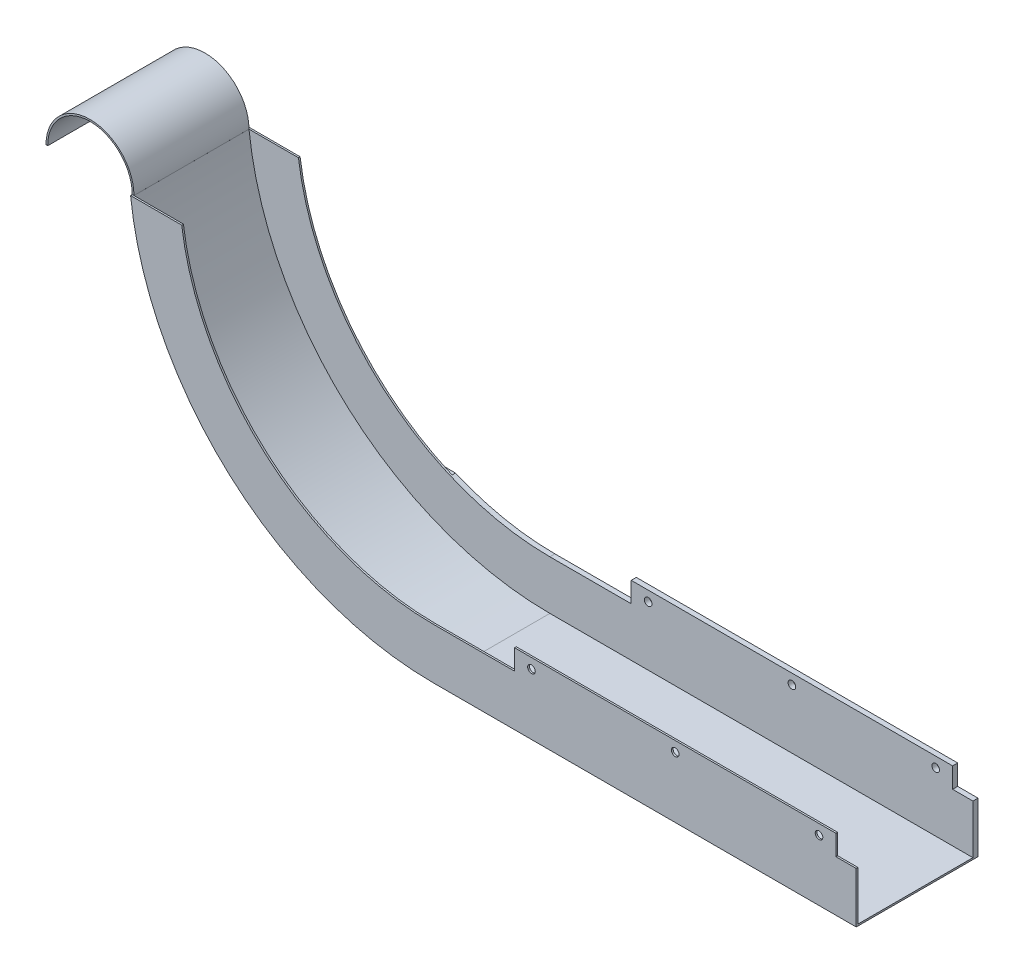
ISO-10303-21;
HEADER;
FILE_DESCRIPTION(('STEP AP214'),'2;1');
FILE_NAME('part.step','',(''),(''),'','','');
FILE_SCHEMA(('AUTOMOTIVE_DESIGN { 1 0 10303 214 1 1 1 1 }'));
ENDSEC;
DATA;
#1=APPLICATION_CONTEXT('core data for automotive mechanical design processes');
#2=APPLICATION_PROTOCOL_DEFINITION('international standard','automotive_design',2000,#1);
#3=PRODUCT_CONTEXT('',#1,'mechanical');
#4=PRODUCT('Part','Part','',(#3));
#5=PRODUCT_RELATED_PRODUCT_CATEGORY('part','',(#4));
#6=PRODUCT_DEFINITION_FORMATION('','',#4);
#7=PRODUCT_DEFINITION_CONTEXT('part definition',#1,'design');
#8=PRODUCT_DEFINITION('design','',#6,#7);
#9=PRODUCT_DEFINITION_SHAPE('','',#8);
#10=(LENGTH_UNIT() NAMED_UNIT(*) SI_UNIT(.MILLI.,.METRE.));
#11=(NAMED_UNIT(*) PLANE_ANGLE_UNIT() SI_UNIT($,.RADIAN.));
#12=(NAMED_UNIT(*) SI_UNIT($,.STERADIAN.) SOLID_ANGLE_UNIT());
#13=UNCERTAINTY_MEASURE_WITH_UNIT(LENGTH_MEASURE(1.E-05),#10,'distance_accuracy_value','');
#14=(GEOMETRIC_REPRESENTATION_CONTEXT(3) GLOBAL_UNCERTAINTY_ASSIGNED_CONTEXT((#13)) GLOBAL_UNIT_ASSIGNED_CONTEXT((#10,
#11,#12)) REPRESENTATION_CONTEXT('',''));
#15=CARTESIAN_POINT('',(0.,0.,0.));
#16=DIRECTION('',(0.,0.,1.));
#17=DIRECTION('',(1.,0.,0.));
#18=AXIS2_PLACEMENT_3D('',#15,#16,#17);
#19=CARTESIAN_POINT('',(468.,41.9999999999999,72.));
#20=DIRECTION('',(0.,-1.,0.));
#21=DIRECTION('',(1.,0.,0.));
#22=AXIS2_PLACEMENT_3D('',#19,#20,#21);
#23=PLANE('',#22);
#24=DIRECTION('',(0.,0.,-1.));
#25=VECTOR('',#24,1.);
#26=CARTESIAN_POINT('',(480.,42.0000000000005,72.));
#27=LINE('',#26,#25);
#28=CARTESIAN_POINT('',(480.,42.0000000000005,72.));
#29=VERTEX_POINT('',#28);
#30=CARTESIAN_POINT('',(480.,42.0000000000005,71.));
#31=VERTEX_POINT('',#30);
#32=EDGE_CURVE('E446',#29,#31,#27,.T.);
#33=ORIENTED_EDGE('',*,*,#32,.T.);
#34=DIRECTION('',(-1.,0.,0.));
#35=VECTOR('',#34,1.);
#36=CARTESIAN_POINT('',(468.,41.9999999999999,71.));
#37=LINE('',#36,#35);
#38=CARTESIAN_POINT('',(468.,41.9999999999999,71.));
#39=VERTEX_POINT('',#38);
#40=EDGE_CURVE('E306',#31,#39,#37,.T.);
#41=ORIENTED_EDGE('',*,*,#40,.T.);
#42=DIRECTION('',(0.,0.,-1.));
#43=VECTOR('',#42,1.);
#44=CARTESIAN_POINT('',(468.,41.9999999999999,72.));
#45=LINE('',#44,#43);
#46=CARTESIAN_POINT('',(468.,41.9999999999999,72.));
#47=VERTEX_POINT('',#46);
#48=EDGE_CURVE('E496',#47,#39,#45,.T.);
#49=ORIENTED_EDGE('',*,*,#48,.F.);
#50=DIRECTION('',(-1.,0.,0.));
#51=VECTOR('',#50,1.);
#52=CARTESIAN_POINT('',(468.,41.9999999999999,72.));
#53=LINE('',#52,#51);
#54=EDGE_CURVE('E386',#29,#47,#53,.T.);
#55=ORIENTED_EDGE('',*,*,#54,.F.);
#56=EDGE_LOOP('',(#33,#41,#49,#55));
#57=FACE_BOUND('',#56,.T.);
#58=ADVANCED_FACE('F32',(#57),#23,.F.);
#59=CARTESIAN_POINT('',(468.,41.9999999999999,72.));
#60=DIRECTION('',(-1.,0.,0.));
#61=DIRECTION('',(0.,0.,1.));
#62=AXIS2_PLACEMENT_3D('',#59,#60,#61);
#63=PLANE('',#62);
#64=ORIENTED_EDGE('',*,*,#48,.T.);
#65=DIRECTION('',(0.,1.,0.));
#66=VECTOR('',#65,1.);
#67=CARTESIAN_POINT('',(468.,41.9999999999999,71.));
#68=LINE('',#67,#66);
#69=CARTESIAN_POINT('',(468.,54.,71.));
#70=VERTEX_POINT('',#69);
#71=EDGE_CURVE('E303',#39,#70,#68,.T.);
#72=ORIENTED_EDGE('',*,*,#71,.T.);
#73=DIRECTION('',(0.,0.,-1.));
#74=VECTOR('',#73,1.);
#75=CARTESIAN_POINT('',(468.,54.,72.));
#76=LINE('',#75,#74);
#77=CARTESIAN_POINT('',(468.,54.,72.));
#78=VERTEX_POINT('',#77);
#79=EDGE_CURVE('E492',#78,#70,#76,.T.);
#80=ORIENTED_EDGE('',*,*,#79,.F.);
#81=DIRECTION('',(0.,1.,0.));
#82=VECTOR('',#81,1.);
#83=CARTESIAN_POINT('',(468.,41.9999999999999,72.));
#84=LINE('',#83,#82);
#85=EDGE_CURVE('E389',#47,#78,#84,.T.);
#86=ORIENTED_EDGE('',*,*,#85,.F.);
#87=EDGE_LOOP('',(#64,#72,#80,#86));
#88=FACE_BOUND('',#87,.T.);
#89=ADVANCED_FACE('F570',(#88),#63,.F.);
#90=CARTESIAN_POINT('',(278.,54.,72.));
#91=DIRECTION('',(0.,-1.,0.));
#92=DIRECTION('',(0.,0.,-1.));
#93=AXIS2_PLACEMENT_3D('',#90,#91,#92);
#94=PLANE('',#93);
#95=ORIENTED_EDGE('',*,*,#79,.T.);
#96=DIRECTION('',(-1.,0.,0.));
#97=VECTOR('',#96,1.);
#98=CARTESIAN_POINT('',(278.,54.,71.));
#99=LINE('',#98,#97);
#100=CARTESIAN_POINT('',(278.,54.,71.));
#101=VERTEX_POINT('',#100);
#102=EDGE_CURVE('E300',#70,#101,#99,.T.);
#103=ORIENTED_EDGE('',*,*,#102,.T.);
#104=DIRECTION('',(0.,0.,-1.));
#105=VECTOR('',#104,1.);
#106=CARTESIAN_POINT('',(278.,54.,72.));
#107=LINE('',#106,#105);
#108=CARTESIAN_POINT('',(278.,54.,72.));
#109=VERTEX_POINT('',#108);
#110=EDGE_CURVE('E488',#109,#101,#107,.T.);
#111=ORIENTED_EDGE('',*,*,#110,.F.);
#112=DIRECTION('',(-1.,0.,0.));
#113=VECTOR('',#112,1.);
#114=CARTESIAN_POINT('',(278.,54.,72.));
#115=LINE('',#114,#113);
#116=EDGE_CURVE('E392',#78,#109,#115,.T.);
#117=ORIENTED_EDGE('',*,*,#116,.F.);
#118=EDGE_LOOP('',(#95,#103,#111,#117));
#119=FACE_BOUND('',#118,.T.);
#120=ADVANCED_FACE('F566',(#119),#94,.F.);
#121=CARTESIAN_POINT('',(278.,41.9999999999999,72.));
#122=DIRECTION('',(1.,0.,0.));
#123=DIRECTION('',(0.,0.,-1.));
#124=AXIS2_PLACEMENT_3D('',#121,#122,#123);
#125=PLANE('',#124);
#126=ORIENTED_EDGE('',*,*,#110,.T.);
#127=DIRECTION('',(0.,-1.,0.));
#128=VECTOR('',#127,1.);
#129=CARTESIAN_POINT('',(278.,41.9999999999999,71.));
#130=LINE('',#129,#128);
#131=CARTESIAN_POINT('',(278.,41.9999999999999,71.));
#132=VERTEX_POINT('',#131);
#133=EDGE_CURVE('E297',#101,#132,#130,.T.);
#134=ORIENTED_EDGE('',*,*,#133,.T.);
#135=DIRECTION('',(0.,0.,-1.));
#136=VECTOR('',#135,1.);
#137=CARTESIAN_POINT('',(278.,41.9999999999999,72.));
#138=LINE('',#137,#136);
#139=CARTESIAN_POINT('',(278.,41.9999999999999,72.));
#140=VERTEX_POINT('',#139);
#141=EDGE_CURVE('E484',#140,#132,#138,.T.);
#142=ORIENTED_EDGE('',*,*,#141,.F.);
#143=DIRECTION('',(0.,-1.,0.));
#144=VECTOR('',#143,1.);
#145=CARTESIAN_POINT('',(278.,41.9999999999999,72.));
#146=LINE('',#145,#144);
#147=EDGE_CURVE('E394',#109,#140,#146,.T.);
#148=ORIENTED_EDGE('',*,*,#147,.F.);
#149=EDGE_LOOP('',(#126,#134,#142,#148));
#150=FACE_BOUND('',#149,.T.);
#151=ADVANCED_FACE('F563',(#150),#125,.F.);
#152=CARTESIAN_POINT('',(229.885438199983,41.9999999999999,72.));
#153=DIRECTION('',(0.,-1.,0.));
#154=DIRECTION('',(0.,0.,-1.));
#155=AXIS2_PLACEMENT_3D('',#152,#153,#154);
#156=PLANE('',#155);
#157=ORIENTED_EDGE('',*,*,#141,.T.);
#158=DIRECTION('',(-1.,0.,0.));
#159=VECTOR('',#158,1.);
#160=CARTESIAN_POINT('',(229.885438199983,41.9999999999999,71.));
#161=LINE('',#160,#159);
#162=CARTESIAN_POINT('',(229.885438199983,42.0000000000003,71.));
#163=VERTEX_POINT('',#162);
#164=EDGE_CURVE('E294',#132,#163,#161,.T.);
#165=ORIENTED_EDGE('',*,*,#164,.T.);
#166=DIRECTION('',(0.,0.,-1.));
#167=VECTOR('',#166,1.);
#168=CARTESIAN_POINT('',(229.885438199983,41.9999999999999,72.));
#169=LINE('',#168,#167);
#170=CARTESIAN_POINT('',(229.885438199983,41.9999999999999,72.));
#171=VERTEX_POINT('',#170);
#172=EDGE_CURVE('E480',#171,#163,#169,.T.);
#173=ORIENTED_EDGE('',*,*,#172,.F.);
#174=DIRECTION('',(-1.,0.,0.));
#175=VECTOR('',#174,1.);
#176=CARTESIAN_POINT('',(229.885438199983,41.9999999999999,72.));
#177=LINE('',#176,#175);
#178=EDGE_CURVE('E396',#140,#171,#177,.T.);
#179=ORIENTED_EDGE('',*,*,#178,.F.);
#180=EDGE_LOOP('',(#157,#165,#173,#179));
#181=FACE_BOUND('',#180,.T.);
#182=ADVANCED_FACE('F558',(#181),#156,.F.);
#183=CARTESIAN_POINT('',(229.885438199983,192.,72.));
#184=DIRECTION('',(0.,0.,-1.));
#185=DIRECTION('',(-1.,0.,0.));
#186=AXIS2_PLACEMENT_3D('',#183,#184,#185);
#187=CYLINDRICAL_SURFACE('',#186,150.);
#188=ORIENTED_EDGE('',*,*,#172,.T.);
#189=CARTESIAN_POINT('',(229.885438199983,192.,71.));
#190=DIRECTION('',(0.,0.,1.));
#191=DIRECTION('',(1.,0.,0.));
#192=AXIS2_PLACEMENT_3D('',#189,#190,#191);
#193=CIRCLE('',#192,150.);
#194=CARTESIAN_POINT('',(81.224750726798,171.999999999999,71.));
#195=VERTEX_POINT('',#194);
#196=EDGE_CURVE('E291',#163,#195,#193,.F.);
#197=ORIENTED_EDGE('',*,*,#196,.T.);
#198=DIRECTION('',(0.,0.,-1.));
#199=VECTOR('',#198,1.);
#200=CARTESIAN_POINT('',(81.224750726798,172.,72.));
#201=LINE('',#200,#199);
#202=CARTESIAN_POINT('',(81.224750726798,172.,72.));
#203=VERTEX_POINT('',#202);
#204=EDGE_CURVE('E476',#203,#195,#201,.T.);
#205=ORIENTED_EDGE('',*,*,#204,.F.);
#206=CARTESIAN_POINT('',(229.885438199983,192.,72.));
#207=DIRECTION('',(0.,0.,-1.));
#208=DIRECTION('',(1.,0.,0.));
#209=AXIS2_PLACEMENT_3D('',#206,#207,#208);
#210=CIRCLE('',#209,150.);
#211=EDGE_CURVE('E398',#171,#203,#210,.T.);
#212=ORIENTED_EDGE('',*,*,#211,.F.);
#213=EDGE_LOOP('',(#188,#197,#205,#212));
#214=FACE_BOUND('',#213,.T.);
#215=ADVANCED_FACE('F555',(#214),#187,.F.);
#216=CARTESIAN_POINT('',(458.,47.9999999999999,72.));
#217=DIRECTION('',(0.,0.,-1.));
#218=DIRECTION('',(-1.,0.,0.));
#219=AXIS2_PLACEMENT_3D('',#216,#217,#218);
#220=CYLINDRICAL_SURFACE('',#219,2.24999999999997);
#221=CARTESIAN_POINT('',(458.,47.9999999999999,71.));
#222=DIRECTION('',(0.,0.,1.));
#223=DIRECTION('',(1.,0.,0.));
#224=AXIS2_PLACEMENT_3D('',#221,#222,#223);
#225=CIRCLE('',#224,2.24999999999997);
#226=CARTESIAN_POINT('',(460.25,47.9999999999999,71.));
#227=VERTEX_POINT('',#226);
#228=EDGE_CURVE('E288',#227,#227,#225,.T.);
#229=ORIENTED_EDGE('',*,*,#228,.F.);
#230=EDGE_LOOP('',(#229));
#231=FACE_BOUND('',#230,.T.);
#232=CARTESIAN_POINT('',(458.,47.9999999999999,72.));
#233=DIRECTION('',(0.,0.,1.));
#234=DIRECTION('',(1.,0.,0.));
#235=AXIS2_PLACEMENT_3D('',#232,#233,#234);
#236=CIRCLE('',#235,2.24999999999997);
#237=CARTESIAN_POINT('',(460.25,47.9999999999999,72.));
#238=VERTEX_POINT('',#237);
#239=EDGE_CURVE('E371',#238,#238,#236,.T.);
#240=ORIENTED_EDGE('',*,*,#239,.T.);
#241=EDGE_LOOP('',(#240));
#242=FACE_BOUND('',#241,.T.);
#243=ADVANCED_FACE('F693',(#231,#242),#220,.F.);
#244=CARTESIAN_POINT('',(373.,47.9999999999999,72.));
#245=DIRECTION('',(0.,0.,-1.));
#246=DIRECTION('',(-1.,0.,0.));
#247=AXIS2_PLACEMENT_3D('',#244,#245,#246);
#248=CYLINDRICAL_SURFACE('',#247,2.24999999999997);
#249=CARTESIAN_POINT('',(373.,47.9999999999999,71.));
#250=DIRECTION('',(0.,0.,1.));
#251=DIRECTION('',(1.,0.,0.));
#252=AXIS2_PLACEMENT_3D('',#249,#250,#251);
#253=CIRCLE('',#252,2.24999999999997);
#254=CARTESIAN_POINT('',(375.25,47.9999999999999,71.));
#255=VERTEX_POINT('',#254);
#256=EDGE_CURVE('E285',#255,#255,#253,.T.);
#257=ORIENTED_EDGE('',*,*,#256,.F.);
#258=EDGE_LOOP('',(#257));
#259=FACE_BOUND('',#258,.T.);
#260=CARTESIAN_POINT('',(373.,47.9999999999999,72.));
#261=DIRECTION('',(0.,0.,1.));
#262=DIRECTION('',(1.,0.,0.));
#263=AXIS2_PLACEMENT_3D('',#260,#261,#262);
#264=CIRCLE('',#263,2.24999999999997);
#265=CARTESIAN_POINT('',(375.25,47.9999999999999,72.));
#266=VERTEX_POINT('',#265);
#267=EDGE_CURVE('E365',#266,#266,#264,.T.);
#268=ORIENTED_EDGE('',*,*,#267,.T.);
#269=EDGE_LOOP('',(#268));
#270=FACE_BOUND('',#269,.T.);
#271=ADVANCED_FACE('F697',(#259,#270),#248,.F.);
#272=CARTESIAN_POINT('',(288.,48.,72.));
#273=DIRECTION('',(0.,0.,-1.));
#274=DIRECTION('',(-1.,0.,0.));
#275=AXIS2_PLACEMENT_3D('',#272,#273,#274);
#276=CYLINDRICAL_SURFACE('',#275,2.24999999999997);
#277=CARTESIAN_POINT('',(288.,48.,71.));
#278=DIRECTION('',(0.,0.,1.));
#279=DIRECTION('',(1.,0.,0.));
#280=AXIS2_PLACEMENT_3D('',#277,#278,#279);
#281=CIRCLE('',#280,2.24999999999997);
#282=CARTESIAN_POINT('',(290.25,48.,71.));
#283=VERTEX_POINT('',#282);
#284=EDGE_CURVE('E36',#283,#283,#281,.T.);
#285=ORIENTED_EDGE('',*,*,#284,.F.);
#286=EDGE_LOOP('',(#285));
#287=FACE_BOUND('',#286,.T.);
#288=CARTESIAN_POINT('',(288.,48.,72.));
#289=DIRECTION('',(0.,0.,1.));
#290=DIRECTION('',(1.,0.,0.));
#291=AXIS2_PLACEMENT_3D('',#288,#289,#290);
#292=CIRCLE('',#291,2.24999999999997);
#293=CARTESIAN_POINT('',(290.25,48.,72.));
#294=VERTEX_POINT('',#293);
#295=EDGE_CURVE('E359',#294,#294,#292,.T.);
#296=ORIENTED_EDGE('',*,*,#295,.T.);
#297=EDGE_LOOP('',(#296));
#298=FACE_BOUND('',#297,.T.);
#299=ADVANCED_FACE('F654',(#287,#298),#276,.F.);
#300=CARTESIAN_POINT('',(229.885438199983,192.,0.));
#301=DIRECTION('',(0.,0.,1.));
#302=DIRECTION('',(1.,0.,0.));
#303=AXIS2_PLACEMENT_3D('',#300,#301,#302);
#304=PLANE('',#303);
#305=CARTESIAN_POINT('',(288.,48.,0.));
#306=DIRECTION('',(0.,0.,1.));
#307=DIRECTION('',(1.,0.,0.));
#308=AXIS2_PLACEMENT_3D('',#305,#306,#307);
#309=CIRCLE('',#308,2.24999999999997);
#310=CARTESIAN_POINT('',(290.25,48.,0.));
#311=VERTEX_POINT('',#310);
#312=EDGE_CURVE('E358',#311,#311,#309,.T.);
#313=ORIENTED_EDGE('',*,*,#312,.T.);
#314=EDGE_LOOP('',(#313));
#315=FACE_BOUND('',#314,.T.);
#316=CARTESIAN_POINT('',(458.,47.9999999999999,0.));
#317=DIRECTION('',(0.,0.,1.));
#318=DIRECTION('',(1.,0.,0.));
#319=AXIS2_PLACEMENT_3D('',#316,#317,#318);
#320=CIRCLE('',#319,2.24999999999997);
#321=CARTESIAN_POINT('',(460.25,47.9999999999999,0.));
#322=VERTEX_POINT('',#321);
#323=EDGE_CURVE('E368',#322,#322,#320,.T.);
#324=ORIENTED_EDGE('',*,*,#323,.T.);
#325=EDGE_LOOP('',(#324));
#326=FACE_BOUND('',#325,.T.);
#327=CARTESIAN_POINT('',(373.,6.,0.));
#328=DIRECTION('',(0.,0.,1.));
#329=DIRECTION('',(1.,0.,0.));
#330=AXIS2_PLACEMENT_3D('',#327,#328,#329);
#331=CIRCLE('',#330,2.24999999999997);
#332=CARTESIAN_POINT('',(375.25,6.,0.));
#333=VERTEX_POINT('',#332);
#334=EDGE_CURVE('E379',#333,#333,#331,.T.);
#335=ORIENTED_EDGE('',*,*,#334,.T.);
#336=EDGE_LOOP('',(#335));
#337=FACE_BOUND('',#336,.T.);
#338=CARTESIAN_POINT('',(288.,6.,0.));
#339=DIRECTION('',(0.,0.,1.));
#340=DIRECTION('',(1.,0.,0.));
#341=AXIS2_PLACEMENT_3D('',#338,#339,#340);
#342=CIRCLE('',#341,2.24999999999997);
#343=CARTESIAN_POINT('',(290.25,6.,0.));
#344=VERTEX_POINT('',#343);
#345=EDGE_CURVE('E382',#344,#344,#342,.T.);
#346=ORIENTED_EDGE('',*,*,#345,.T.);
#347=EDGE_LOOP('',(#346));
#348=FACE_BOUND('',#347,.T.);
#349=CARTESIAN_POINT('',(458.,6.,0.));
#350=DIRECTION('',(0.,0.,1.));
#351=DIRECTION('',(1.,0.,0.));
#352=AXIS2_PLACEMENT_3D('',#349,#350,#351);
#353=CIRCLE('',#352,2.24999999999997);
#354=CARTESIAN_POINT('',(460.25,6.,0.));
#355=VERTEX_POINT('',#354);
#356=EDGE_CURVE('E374',#355,#355,#353,.T.);
#357=ORIENTED_EDGE('',*,*,#356,.T.);
#358=EDGE_LOOP('',(#357));
#359=FACE_BOUND('',#358,.T.);
#360=CARTESIAN_POINT('',(373.,47.9999999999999,0.));
#361=DIRECTION('',(0.,0.,1.));
#362=DIRECTION('',(1.,0.,0.));
#363=AXIS2_PLACEMENT_3D('',#360,#361,#362);
#364=CIRCLE('',#363,2.24999999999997);
#365=CARTESIAN_POINT('',(375.25,47.9999999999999,0.));
#366=VERTEX_POINT('',#365);
#367=EDGE_CURVE('E362',#366,#366,#364,.T.);
#368=ORIENTED_EDGE('',*,*,#367,.T.);
#369=EDGE_LOOP('',(#368));
#370=FACE_BOUND('',#369,.T.);
#371=DIRECTION('',(-1.,0.,0.));
#372=VECTOR('',#371,1.);
#373=CARTESIAN_POINT('',(1150.25281380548,54.,0.));
#374=LINE('',#373,#372);
#375=CARTESIAN_POINT('',(171.097684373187,54.,0.));
#376=VERTEX_POINT('',#375);
#377=CARTESIAN_POINT('',(114.317276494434,54.,0.));
#378=VERTEX_POINT('',#377);
#379=EDGE_CURVE('E309',#376,#378,#374,.T.);
#380=ORIENTED_EDGE('',*,*,#379,.F.);
#381=CARTESIAN_POINT('',(229.885438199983,192.,0.));
#382=DIRECTION('',(0.,0.,-1.));
#383=DIRECTION('',(1.,0.,0.));
#384=AXIS2_PLACEMENT_3D('',#381,#382,#383);
#385=CIRCLE('',#384,150.);
#386=CARTESIAN_POINT('',(229.885438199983,41.9999999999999,0.));
#387=VERTEX_POINT('',#386);
#388=EDGE_CURVE('E423',#387,#376,#385,.T.);
#389=ORIENTED_EDGE('',*,*,#388,.F.);
#390=DIRECTION('',(-1.,0.,0.));
#391=VECTOR('',#390,1.);
#392=CARTESIAN_POINT('',(229.885438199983,41.9999999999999,0.));
#393=LINE('',#392,#391);
#394=CARTESIAN_POINT('',(278.,41.9999999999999,0.));
#395=VERTEX_POINT('',#394);
#396=EDGE_CURVE('E420',#395,#387,#393,.T.);
#397=ORIENTED_EDGE('',*,*,#396,.F.);
#398=DIRECTION('',(0.,-1.,0.));
#399=VECTOR('',#398,1.);
#400=CARTESIAN_POINT('',(278.,41.9999999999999,0.));
#401=LINE('',#400,#399);
#402=CARTESIAN_POINT('',(278.,54.,0.));
#403=VERTEX_POINT('',#402);
#404=EDGE_CURVE('E417',#403,#395,#401,.T.);
#405=ORIENTED_EDGE('',*,*,#404,.F.);
#406=DIRECTION('',(-1.,0.,0.));
#407=VECTOR('',#406,1.);
#408=CARTESIAN_POINT('',(278.,54.,0.));
#409=LINE('',#408,#407);
#410=CARTESIAN_POINT('',(468.,54.,0.));
#411=VERTEX_POINT('',#410);
#412=EDGE_CURVE('E414',#411,#403,#409,.T.);
#413=ORIENTED_EDGE('',*,*,#412,.F.);
#414=DIRECTION('',(0.,1.,0.));
#415=VECTOR('',#414,1.);
#416=CARTESIAN_POINT('',(468.,41.9999999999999,0.));
#417=LINE('',#416,#415);
#418=CARTESIAN_POINT('',(468.,41.9999999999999,0.));
#419=VERTEX_POINT('',#418);
#420=EDGE_CURVE('E411',#419,#411,#417,.T.);
#421=ORIENTED_EDGE('',*,*,#420,.F.);
#422=DIRECTION('',(-1.,0.,0.));
#423=VECTOR('',#422,1.);
#424=CARTESIAN_POINT('',(468.,41.9999999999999,0.));
#425=LINE('',#424,#423);
#426=CARTESIAN_POINT('',(480.,42.0000000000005,0.));
#427=VERTEX_POINT('',#426);
#428=EDGE_CURVE('E385',#427,#419,#425,.T.);
#429=ORIENTED_EDGE('',*,*,#428,.F.);
#430=DIRECTION('',(0.,1.,0.));
#431=VECTOR('',#430,1.);
#432=CARTESIAN_POINT('',(480.,12.0000000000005,0.));
#433=LINE('',#432,#431);
#434=CARTESIAN_POINT('',(480.,12.0000000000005,0.));
#435=VERTEX_POINT('',#434);
#436=EDGE_CURVE('E390',#435,#427,#433,.T.);
#437=ORIENTED_EDGE('',*,*,#436,.F.);
#438=DIRECTION('',(1.,0.,0.));
#439=VECTOR('',#438,1.);
#440=CARTESIAN_POINT('',(468.,11.9999999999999,0.));
#441=LINE('',#440,#439);
#442=CARTESIAN_POINT('',(468.,11.9999999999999,0.));
#443=VERTEX_POINT('',#442);
#444=EDGE_CURVE('E441',#443,#435,#441,.T.);
#445=ORIENTED_EDGE('',*,*,#444,.F.);
#446=DIRECTION('',(0.,1.,0.));
#447=VECTOR('',#446,1.);
#448=CARTESIAN_POINT('',(468.,-1.13686837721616E-13,0.));
#449=LINE('',#448,#447);
#450=CARTESIAN_POINT('',(468.,-1.13686837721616E-13,0.));
#451=VERTEX_POINT('',#450);
#452=EDGE_CURVE('E438',#451,#443,#449,.T.);
#453=ORIENTED_EDGE('',*,*,#452,.F.);
#454=DIRECTION('',(1.,0.,0.));
#455=VECTOR('',#454,1.);
#456=CARTESIAN_POINT('',(278.,-1.13686837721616E-13,0.));
#457=LINE('',#456,#455);
#458=CARTESIAN_POINT('',(278.,-1.13686837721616E-13,0.));
#459=VERTEX_POINT('',#458);
#460=EDGE_CURVE('E435',#459,#451,#457,.T.);
#461=ORIENTED_EDGE('',*,*,#460,.F.);
#462=DIRECTION('',(0.,-1.,0.));
#463=VECTOR('',#462,1.);
#464=CARTESIAN_POINT('',(278.,-1.13686837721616E-13,0.));
#465=LINE('',#464,#463);
#466=CARTESIAN_POINT('',(278.,11.9999999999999,0.));
#467=VERTEX_POINT('',#466);
#468=EDGE_CURVE('E432',#467,#459,#465,.T.);
#469=ORIENTED_EDGE('',*,*,#468,.F.);
#470=DIRECTION('',(1.,0.,0.));
#471=VECTOR('',#470,1.);
#472=CARTESIAN_POINT('',(229.885438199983,11.9999999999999,0.));
#473=LINE('',#472,#471);
#474=CARTESIAN_POINT('',(229.885438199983,12.0000000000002,0.));
#475=VERTEX_POINT('',#474);
#476=EDGE_CURVE('E429',#475,#467,#473,.T.);
#477=ORIENTED_EDGE('',*,*,#476,.F.);
#478=CARTESIAN_POINT('',(229.885438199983,192.,0.));
#479=DIRECTION('',(0.,0.,1.));
#480=DIRECTION('',(1.,0.,0.));
#481=AXIS2_PLACEMENT_3D('',#478,#479,#480);
#482=CIRCLE('',#481,180.);
#483=EDGE_CURVE('E426',#378,#475,#482,.T.);
#484=ORIENTED_EDGE('',*,*,#483,.F.);
#485=EDGE_LOOP('',(#380,#389,#397,#405,#413,#421,#429,#437,#445,#453,#461,#469,#477,#484));
#486=FACE_BOUND('',#485,.T.);
#487=ADVANCED_FACE('F528',(#315,#326,#337,#348,#359,#370,#486),#304,.F.);
#488=CARTESIAN_POINT('',(0.,172.,72.));
#489=DIRECTION('',(0.,1.,0.));
#490=DIRECTION('',(0.,0.,1.));
#491=AXIS2_PLACEMENT_3D('',#488,#489,#490);
#492=PLANE('',#491);
#493=DIRECTION('',(0.,0.,-1.));
#494=VECTOR('',#493,1.);
#495=CARTESIAN_POINT('',(1.,172.,72.));
#496=LINE('',#495,#494);
#497=CARTESIAN_POINT('',(1.,172.,71.));
#498=VERTEX_POINT('',#497);
#499=CARTESIAN_POINT('',(0.99999999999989,172.,3.));
#500=VERTEX_POINT('',#499);
#501=EDGE_CURVE('E465',#498,#500,#496,.T.);
#502=ORIENTED_EDGE('',*,*,#501,.F.);
#503=DIRECTION('',(-1.,0.,0.));
#504=VECTOR('',#503,1.);
#505=CARTESIAN_POINT('',(1150.25281380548,172.,71.));
#506=LINE('',#505,#504);
#507=CARTESIAN_POINT('',(0.,172.,71.));
#508=VERTEX_POINT('',#507);
#509=EDGE_CURVE('E321',#498,#508,#506,.T.);
#510=ORIENTED_EDGE('',*,*,#509,.T.);
#511=DIRECTION('',(0.,0.,-1.));
#512=VECTOR('',#511,1.);
#513=CARTESIAN_POINT('',(0.,172.,72.));
#514=LINE('',#513,#512);
#515=CARTESIAN_POINT('',(0.,172.,3.));
#516=VERTEX_POINT('',#515);
#517=EDGE_CURVE('E469',#508,#516,#514,.T.);
#518=ORIENTED_EDGE('',*,*,#517,.T.);
#519=DIRECTION('',(-1.,0.,0.));
#520=VECTOR('',#519,1.);
#521=CARTESIAN_POINT('',(1150.25281380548,172.,3.));
#522=LINE('',#521,#520);
#523=EDGE_CURVE('E317',#500,#516,#522,.T.);
#524=ORIENTED_EDGE('',*,*,#523,.F.);
#525=EDGE_LOOP('',(#502,#510,#518,#524));
#526=FACE_BOUND('',#525,.T.);
#527=ADVANCED_FACE('F618',(#526),#492,.F.);
#528=CARTESIAN_POINT('',(229.885438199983,192.,72.));
#529=DIRECTION('',(0.,0.,1.));
#530=DIRECTION('',(1.,0.,0.));
#531=AXIS2_PLACEMENT_3D('',#528,#529,#530);
#532=PLANE('',#531);
#533=DIRECTION('',(1.,0.,0.));
#534=VECTOR('',#533,1.);
#535=CARTESIAN_POINT('',(229.885438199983,11.9999999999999,72.));
#536=LINE('',#535,#534);
#537=CARTESIAN_POINT('',(229.885438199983,12.0000000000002,72.));
#538=VERTEX_POINT('',#537);
#539=CARTESIAN_POINT('',(480.,12.0000000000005,72.));
#540=VERTEX_POINT('',#539);
#541=EDGE_CURVE('E404',#538,#540,#536,.T.);
#542=ORIENTED_EDGE('',*,*,#541,.T.);
#543=DIRECTION('',(0.,1.,0.));
#544=VECTOR('',#543,1.);
#545=CARTESIAN_POINT('',(480.,12.0000000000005,72.));
#546=LINE('',#545,#544);
#547=EDGE_CURVE('E406',#540,#29,#546,.T.);
#548=ORIENTED_EDGE('',*,*,#547,.T.);
#549=ORIENTED_EDGE('',*,*,#54,.T.);
#550=ORIENTED_EDGE('',*,*,#85,.T.);
#551=ORIENTED_EDGE('',*,*,#116,.T.);
#552=ORIENTED_EDGE('',*,*,#147,.T.);
#553=ORIENTED_EDGE('',*,*,#178,.T.);
#554=ORIENTED_EDGE('',*,*,#211,.T.);
#555=DIRECTION('',(-1.,0.,0.));
#556=VECTOR('',#555,1.);
#557=CARTESIAN_POINT('',(52.,172.,72.));
#558=LINE('',#557,#556);
#559=CARTESIAN_POINT('',(50.9999999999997,172.,72.));
#560=VERTEX_POINT('',#559);
#561=EDGE_CURVE('E400',#203,#560,#558,.T.);
#562=ORIENTED_EDGE('',*,*,#561,.T.);
#563=CARTESIAN_POINT('',(229.885438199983,192.,72.));
#564=DIRECTION('',(0.,0.,1.));
#565=DIRECTION('',(1.,0.,0.));
#566=AXIS2_PLACEMENT_3D('',#563,#564,#565);
#567=CIRCLE('',#566,180.);
#568=EDGE_CURVE('E402',#560,#538,#567,.T.);
#569=ORIENTED_EDGE('',*,*,#568,.T.);
#570=EDGE_LOOP('',(#542,#548,#549,#550,#551,#552,#553,#554,#562,#569));
#571=FACE_BOUND('',#570,.T.);
#572=ORIENTED_EDGE('',*,*,#267,.F.);
#573=EDGE_LOOP('',(#572));
#574=FACE_BOUND('',#573,.T.);
#575=ORIENTED_EDGE('',*,*,#239,.F.);
#576=EDGE_LOOP('',(#575));
#577=FACE_BOUND('',#576,.T.);
#578=ORIENTED_EDGE('',*,*,#295,.F.);
#579=EDGE_LOOP('',(#578));
#580=FACE_BOUND('',#579,.T.);
#581=ADVANCED_FACE('F576',(#571,#574,#577,#580),#532,.T.);
#582=CARTESIAN_POINT('',(468.,41.9999999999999,3.));
#583=VERTEX_POINT('',#582);
#584=EDGE_CURVE('E495',#583,#419,#45,.T.);
#585=ORIENTED_EDGE('',*,*,#584,.F.);
#586=DIRECTION('',(1.,0.,0.));
#587=VECTOR('',#586,1.);
#588=CARTESIAN_POINT('',(468.,41.9999999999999,3.));
#589=LINE('',#588,#587);
#590=CARTESIAN_POINT('',(480.,42.0000000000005,3.));
#591=VERTEX_POINT('',#590);
#592=EDGE_CURVE('E282',#583,#591,#589,.T.);
#593=ORIENTED_EDGE('',*,*,#592,.T.);
#594=EDGE_CURVE('E408',#591,#427,#27,.T.);
#595=ORIENTED_EDGE('',*,*,#594,.T.);
#596=ORIENTED_EDGE('',*,*,#428,.T.);
#597=EDGE_LOOP('',(#585,#593,#595,#596));
#598=FACE_BOUND('',#597,.T.);
#599=ADVANCED_FACE('F34',(#598),#23,.F.);
#600=CARTESIAN_POINT('',(468.,54.,3.));
#601=VERTEX_POINT('',#600);
#602=EDGE_CURVE('E491',#601,#411,#76,.T.);
#603=ORIENTED_EDGE('',*,*,#602,.F.);
#604=DIRECTION('',(0.,-1.,0.));
#605=VECTOR('',#604,1.);
#606=CARTESIAN_POINT('',(468.,41.9999999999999,3.));
#607=LINE('',#606,#605);
#608=EDGE_CURVE('E279',#601,#583,#607,.T.);
#609=ORIENTED_EDGE('',*,*,#608,.T.);
#610=ORIENTED_EDGE('',*,*,#584,.T.);
#611=ORIENTED_EDGE('',*,*,#420,.T.);
#612=EDGE_LOOP('',(#603,#609,#610,#611));
#613=FACE_BOUND('',#612,.T.);
#614=ADVANCED_FACE('F533',(#613),#63,.F.);
#615=CARTESIAN_POINT('',(278.,54.,3.));
#616=VERTEX_POINT('',#615);
#617=EDGE_CURVE('E487',#616,#403,#107,.T.);
#618=ORIENTED_EDGE('',*,*,#617,.F.);
#619=DIRECTION('',(1.,0.,0.));
#620=VECTOR('',#619,1.);
#621=CARTESIAN_POINT('',(278.,54.,3.));
#622=LINE('',#621,#620);
#623=EDGE_CURVE('E276',#616,#601,#622,.T.);
#624=ORIENTED_EDGE('',*,*,#623,.T.);
#625=ORIENTED_EDGE('',*,*,#602,.T.);
#626=ORIENTED_EDGE('',*,*,#412,.T.);
#627=EDGE_LOOP('',(#618,#624,#625,#626));
#628=FACE_BOUND('',#627,.T.);
#629=ADVANCED_FACE('F536',(#628),#94,.F.);
#630=CARTESIAN_POINT('',(278.,41.9999999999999,3.));
#631=VERTEX_POINT('',#630);
#632=EDGE_CURVE('E483',#631,#395,#138,.T.);
#633=ORIENTED_EDGE('',*,*,#632,.F.);
#634=DIRECTION('',(0.,1.,0.));
#635=VECTOR('',#634,1.);
#636=CARTESIAN_POINT('',(278.,41.9999999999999,3.));
#637=LINE('',#636,#635);
#638=EDGE_CURVE('E273',#631,#616,#637,.T.);
#639=ORIENTED_EDGE('',*,*,#638,.T.);
#640=ORIENTED_EDGE('',*,*,#617,.T.);
#641=ORIENTED_EDGE('',*,*,#404,.T.);
#642=EDGE_LOOP('',(#633,#639,#640,#641));
#643=FACE_BOUND('',#642,.T.);
#644=ADVANCED_FACE('F539',(#643),#125,.F.);
#645=CARTESIAN_POINT('',(229.885438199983,42.0000000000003,3.));
#646=VERTEX_POINT('',#645);
#647=EDGE_CURVE('E479',#646,#387,#169,.T.);
#648=ORIENTED_EDGE('',*,*,#647,.F.);
#649=DIRECTION('',(1.,0.,0.));
#650=VECTOR('',#649,1.);
#651=CARTESIAN_POINT('',(229.885438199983,41.9999999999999,3.));
#652=LINE('',#651,#650);
#653=EDGE_CURVE('E270',#646,#631,#652,.T.);
#654=ORIENTED_EDGE('',*,*,#653,.T.);
#655=ORIENTED_EDGE('',*,*,#632,.T.);
#656=ORIENTED_EDGE('',*,*,#396,.T.);
#657=EDGE_LOOP('',(#648,#654,#655,#656));
#658=FACE_BOUND('',#657,.T.);
#659=ADVANCED_FACE('F543',(#658),#156,.F.);
#660=CARTESIAN_POINT('',(81.224750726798,171.999999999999,3.));
#661=VERTEX_POINT('',#660);
#662=CARTESIAN_POINT('',(81.224750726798,172.,2.));
#663=VERTEX_POINT('',#662);
#664=EDGE_CURVE('E475',#661,#663,#201,.T.);
#665=ORIENTED_EDGE('',*,*,#664,.F.);
#666=CARTESIAN_POINT('',(229.885438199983,192.,3.));
#667=DIRECTION('',(0.,0.,-1.));
#668=DIRECTION('',(-1.,0.,0.));
#669=AXIS2_PLACEMENT_3D('',#666,#667,#668);
#670=CIRCLE('',#669,150.);
#671=EDGE_CURVE('E267',#661,#646,#670,.F.);
#672=ORIENTED_EDGE('',*,*,#671,.T.);
#673=ORIENTED_EDGE('',*,*,#647,.T.);
#674=ORIENTED_EDGE('',*,*,#388,.T.);
#675=DIRECTION('',(0.,0.,-1.));
#676=VECTOR('',#675,1.);
#677=CARTESIAN_POINT('',(171.097684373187,54.,72.));
#678=LINE('',#677,#676);
#679=CARTESIAN_POINT('',(171.097684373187,54.,2.));
#680=VERTEX_POINT('',#679);
#681=EDGE_CURVE('E342',#376,#680,#678,.F.);
#682=ORIENTED_EDGE('',*,*,#681,.T.);
#683=CARTESIAN_POINT('',(229.885438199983,192.,2.));
#684=DIRECTION('',(0.,0.,1.));
#685=DIRECTION('',(1.,0.,0.));
#686=AXIS2_PLACEMENT_3D('',#683,#684,#685);
#687=CIRCLE('',#686,150.);
#688=EDGE_CURVE('E345',#680,#663,#687,.F.);
#689=ORIENTED_EDGE('',*,*,#688,.T.);
#690=EDGE_LOOP('',(#665,#672,#673,#674,#682,#689));
#691=FACE_BOUND('',#690,.T.);
#692=ADVANCED_FACE('F547',(#691),#187,.F.);
#693=CARTESIAN_POINT('',(52.,172.,72.));
#694=DIRECTION('',(0.,-1.,0.));
#695=DIRECTION('',(1.,0.,0.));
#696=AXIS2_PLACEMENT_3D('',#693,#694,#695);
#697=PLANE('',#696);
#698=ORIENTED_EDGE('',*,*,#204,.T.);
#699=DIRECTION('',(1.,0.,0.));
#700=VECTOR('',#699,1.);
#701=CARTESIAN_POINT('',(229.885438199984,171.999999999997,71.));
#702=LINE('',#701,#700);
#703=CARTESIAN_POINT('',(52.0062657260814,172.,71.));
#704=VERTEX_POINT('',#703);
#705=EDGE_CURVE('E503',#704,#195,#702,.T.);
#706=ORIENTED_EDGE('',*,*,#705,.F.);
#707=DIRECTION('',(0.,0.,-1.));
#708=VECTOR('',#707,1.);
#709=CARTESIAN_POINT('',(52.0062657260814,172.,72.));
#710=LINE('',#709,#708);
#711=CARTESIAN_POINT('',(52.0062657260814,172.,3.));
#712=VERTEX_POINT('',#711);
#713=EDGE_CURVE('E240',#712,#704,#710,.F.);
#714=ORIENTED_EDGE('',*,*,#713,.F.);
#715=DIRECTION('',(-1.,0.,0.));
#716=VECTOR('',#715,1.);
#717=CARTESIAN_POINT('',(229.885438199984,171.999999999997,3.));
#718=LINE('',#717,#716);
#719=EDGE_CURVE('E259',#661,#712,#718,.T.);
#720=ORIENTED_EDGE('',*,*,#719,.F.);
#721=ORIENTED_EDGE('',*,*,#664,.T.);
#722=DIRECTION('',(-1.,0.,0.));
#723=VECTOR('',#722,1.);
#724=CARTESIAN_POINT('',(1150.25281380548,172.,2.));
#725=LINE('',#724,#723);
#726=CARTESIAN_POINT('',(50.9999999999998,172.,2.));
#727=VERTEX_POINT('',#726);
#728=EDGE_CURVE('E314',#663,#727,#725,.T.);
#729=ORIENTED_EDGE('',*,*,#728,.T.);
#730=DIRECTION('',(0.,0.,-1.));
#731=VECTOR('',#730,1.);
#732=CARTESIAN_POINT('',(51.,172.,72.));
#733=LINE('',#732,#731);
#734=CARTESIAN_POINT('',(50.9999999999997,172.,3.));
#735=VERTEX_POINT('',#734);
#736=EDGE_CURVE('E461',#735,#727,#733,.T.);
#737=ORIENTED_EDGE('',*,*,#736,.F.);
#738=CARTESIAN_POINT('',(52.,172.,3.));
#739=VERTEX_POINT('',#738);
#740=EDGE_CURVE('E320',#739,#735,#522,.T.);
#741=ORIENTED_EDGE('',*,*,#740,.F.);
#742=DIRECTION('',(0.,0.,-1.));
#743=VECTOR('',#742,1.);
#744=CARTESIAN_POINT('',(52.,172.,72.));
#745=LINE('',#744,#743);
#746=CARTESIAN_POINT('',(52.,172.,71.));
#747=VERTEX_POINT('',#746);
#748=EDGE_CURVE('E472',#747,#739,#745,.T.);
#749=ORIENTED_EDGE('',*,*,#748,.F.);
#750=CARTESIAN_POINT('',(51.,172.,71.));
#751=VERTEX_POINT('',#750);
#752=EDGE_CURVE('E57',#747,#751,#506,.T.);
#753=ORIENTED_EDGE('',*,*,#752,.T.);
#754=EDGE_CURVE('E462',#560,#751,#733,.T.);
#755=ORIENTED_EDGE('',*,*,#754,.F.);
#756=ORIENTED_EDGE('',*,*,#561,.F.);
#757=EDGE_LOOP('',(#698,#706,#714,#720,#721,#729,#737,#741,#749,#753,#755,#756));
#758=FACE_BOUND('',#757,.T.);
#759=ADVANCED_FACE('F549',(#758),#697,.F.);
#760=CARTESIAN_POINT('',(26.,172.,72.));
#761=DIRECTION('',(0.,0.,-1.));
#762=DIRECTION('',(-1.,0.,0.));
#763=AXIS2_PLACEMENT_3D('',#760,#761,#762);
#764=CYLINDRICAL_SURFACE('',#763,26.);
#765=CARTESIAN_POINT('',(26.,172.,3.));
#766=DIRECTION('',(0.,0.,1.));
#767=DIRECTION('',(1.,0.,0.));
#768=AXIS2_PLACEMENT_3D('',#765,#766,#767);
#769=CIRCLE('',#768,26.);
#770=EDGE_CURVE('E351',#739,#516,#769,.T.);
#771=ORIENTED_EDGE('',*,*,#770,.T.);
#772=ORIENTED_EDGE('',*,*,#517,.F.);
#773=CARTESIAN_POINT('',(26.,172.,71.));
#774=DIRECTION('',(0.,0.,-1.));
#775=DIRECTION('',(-1.,0.,0.));
#776=AXIS2_PLACEMENT_3D('',#773,#774,#775);
#777=CIRCLE('',#776,26.);
#778=EDGE_CURVE('E356',#508,#747,#777,.T.);
#779=ORIENTED_EDGE('',*,*,#778,.T.);
#780=ORIENTED_EDGE('',*,*,#748,.T.);
#781=EDGE_LOOP('',(#771,#772,#779,#780));
#782=FACE_BOUND('',#781,.T.);
#783=ADVANCED_FACE('F621',(#782),#764,.T.);
#784=CARTESIAN_POINT('',(26.,172.,72.));
#785=DIRECTION('',(0.,0.,-1.));
#786=DIRECTION('',(-1.,0.,0.));
#787=AXIS2_PLACEMENT_3D('',#784,#785,#786);
#788=CYLINDRICAL_SURFACE('',#787,25.);
#789=EDGE_CURVE('E466',#751,#735,#733,.T.);
#790=ORIENTED_EDGE('',*,*,#789,.F.);
#791=CARTESIAN_POINT('',(26.,172.,71.));
#792=DIRECTION('',(0.,0.,-1.));
#793=DIRECTION('',(-1.,0.,0.));
#794=AXIS2_PLACEMENT_3D('',#791,#792,#793);
#795=CIRCLE('',#794,25.);
#796=EDGE_CURVE('E353',#751,#498,#795,.F.);
#797=ORIENTED_EDGE('',*,*,#796,.T.);
#798=ORIENTED_EDGE('',*,*,#501,.T.);
#799=CARTESIAN_POINT('',(26.,172.,3.));
#800=DIRECTION('',(0.,0.,1.));
#801=DIRECTION('',(1.,0.,0.));
#802=AXIS2_PLACEMENT_3D('',#799,#800,#801);
#803=CIRCLE('',#802,25.);
#804=EDGE_CURVE('E348',#500,#735,#803,.F.);
#805=ORIENTED_EDGE('',*,*,#804,.T.);
#806=EDGE_LOOP('',(#790,#797,#798,#805));
#807=FACE_BOUND('',#806,.T.);
#808=ADVANCED_FACE('F612',(#807),#788,.F.);
#809=CARTESIAN_POINT('',(229.885438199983,192.,72.));
#810=DIRECTION('',(0.,0.,-1.));
#811=DIRECTION('',(-1.,0.,0.));
#812=AXIS2_PLACEMENT_3D('',#809,#810,#811);
#813=CYLINDRICAL_SURFACE('',#812,180.);
#814=ORIENTED_EDGE('',*,*,#736,.T.);
#815=CARTESIAN_POINT('',(229.885438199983,192.,2.));
#816=DIRECTION('',(0.,0.,1.));
#817=DIRECTION('',(1.,0.,0.));
#818=AXIS2_PLACEMENT_3D('',#815,#816,#817);
#819=CIRCLE('',#818,180.);
#820=CARTESIAN_POINT('',(114.317276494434,54.,2.));
#821=VERTEX_POINT('',#820);
#822=EDGE_CURVE('E11',#727,#821,#819,.T.);
#823=ORIENTED_EDGE('',*,*,#822,.T.);
#824=DIRECTION('',(0.,0.,-1.));
#825=VECTOR('',#824,1.);
#826=CARTESIAN_POINT('',(114.317276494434,54.,72.));
#827=LINE('',#826,#825);
#828=EDGE_CURVE('E41',#821,#378,#827,.T.);
#829=ORIENTED_EDGE('',*,*,#828,.T.);
#830=ORIENTED_EDGE('',*,*,#483,.T.);
#831=DIRECTION('',(0.,0.,-1.));
#832=VECTOR('',#831,1.);
#833=CARTESIAN_POINT('',(229.885438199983,12.0000000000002,72.));
#834=LINE('',#833,#832);
#835=EDGE_CURVE('E459',#538,#475,#834,.T.);
#836=ORIENTED_EDGE('',*,*,#835,.F.);
#837=ORIENTED_EDGE('',*,*,#568,.F.);
#838=ORIENTED_EDGE('',*,*,#754,.T.);
#839=ORIENTED_EDGE('',*,*,#789,.T.);
#840=EDGE_LOOP('',(#814,#823,#829,#830,#836,#837,#838,#839));
#841=FACE_BOUND('',#840,.T.);
#842=ADVANCED_FACE('F601',(#841),#813,.T.);
#843=CARTESIAN_POINT('',(278.,-1.13686837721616E-13,72.));
#844=DIRECTION('',(1.,0.,0.));
#845=DIRECTION('',(0.,0.,-1.));
#846=AXIS2_PLACEMENT_3D('',#843,#844,#845);
#847=PLANE('',#846);
#848=DIRECTION('',(0.,0.,-1.));
#849=VECTOR('',#848,1.);
#850=CARTESIAN_POINT('',(278.,-1.13686837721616E-13,72.));
#851=LINE('',#850,#849);
#852=CARTESIAN_POINT('',(278.,0.,2.));
#853=VERTEX_POINT('',#852);
#854=EDGE_CURVE('E455',#853,#459,#851,.T.);
#855=ORIENTED_EDGE('',*,*,#854,.F.);
#856=DIRECTION('',(0.,1.,0.));
#857=VECTOR('',#856,1.);
#858=CARTESIAN_POINT('',(278.,-1.13686837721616E-13,2.));
#859=LINE('',#858,#857);
#860=CARTESIAN_POINT('',(278.,12.,2.));
#861=VERTEX_POINT('',#860);
#862=EDGE_CURVE('E339',#853,#861,#859,.T.);
#863=ORIENTED_EDGE('',*,*,#862,.T.);
#864=DIRECTION('',(0.,0.,-1.));
#865=VECTOR('',#864,1.);
#866=CARTESIAN_POINT('',(278.,11.9999999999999,72.));
#867=LINE('',#866,#865);
#868=EDGE_CURVE('E457',#861,#467,#867,.T.);
#869=ORIENTED_EDGE('',*,*,#868,.T.);
#870=ORIENTED_EDGE('',*,*,#468,.T.);
#871=EDGE_LOOP('',(#855,#863,#869,#870));
#872=FACE_BOUND('',#871,.T.);
#873=ADVANCED_FACE('F595',(#872),#847,.F.);
#874=CARTESIAN_POINT('',(278.,-1.13686837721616E-13,72.));
#875=DIRECTION('',(0.,1.,0.));
#876=DIRECTION('',(0.,0.,1.));
#877=AXIS2_PLACEMENT_3D('',#874,#875,#876);
#878=PLANE('',#877);
#879=DIRECTION('',(0.,0.,-1.));
#880=VECTOR('',#879,1.);
#881=CARTESIAN_POINT('',(468.,-1.13686837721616E-13,72.));
#882=LINE('',#881,#880);
#883=CARTESIAN_POINT('',(468.,0.,2.));
#884=VERTEX_POINT('',#883);
#885=EDGE_CURVE('E453',#884,#451,#882,.T.);
#886=ORIENTED_EDGE('',*,*,#885,.F.);
#887=DIRECTION('',(-1.,0.,0.));
#888=VECTOR('',#887,1.);
#889=CARTESIAN_POINT('',(1150.25281380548,0.,2.));
#890=LINE('',#889,#888);
#891=EDGE_CURVE('E326',#884,#853,#890,.T.);
#892=ORIENTED_EDGE('',*,*,#891,.T.);
#893=ORIENTED_EDGE('',*,*,#854,.T.);
#894=ORIENTED_EDGE('',*,*,#460,.T.);
#895=EDGE_LOOP('',(#886,#892,#893,#894));
#896=FACE_BOUND('',#895,.T.);
#897=ADVANCED_FACE('F592',(#896),#878,.F.);
#898=CARTESIAN_POINT('',(468.,-1.13686837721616E-13,72.));
#899=DIRECTION('',(-1.,0.,0.));
#900=DIRECTION('',(0.,0.,1.));
#901=AXIS2_PLACEMENT_3D('',#898,#899,#900);
#902=PLANE('',#901);
#903=DIRECTION('',(0.,0.,-1.));
#904=VECTOR('',#903,1.);
#905=CARTESIAN_POINT('',(468.,11.9999999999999,72.));
#906=LINE('',#905,#904);
#907=CARTESIAN_POINT('',(468.,11.9999999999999,2.));
#908=VERTEX_POINT('',#907);
#909=EDGE_CURVE('E451',#908,#443,#906,.T.);
#910=ORIENTED_EDGE('',*,*,#909,.F.);
#911=DIRECTION('',(0.,-1.,0.));
#912=VECTOR('',#911,1.);
#913=CARTESIAN_POINT('',(468.,-1.13686837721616E-13,2.));
#914=LINE('',#913,#912);
#915=EDGE_CURVE('E329',#908,#884,#914,.T.);
#916=ORIENTED_EDGE('',*,*,#915,.T.);
#917=ORIENTED_EDGE('',*,*,#885,.T.);
#918=ORIENTED_EDGE('',*,*,#452,.T.);
#919=EDGE_LOOP('',(#910,#916,#917,#918));
#920=FACE_BOUND('',#919,.T.);
#921=ADVANCED_FACE('F588',(#920),#902,.F.);
#922=CARTESIAN_POINT('',(468.,11.9999999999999,72.));
#923=DIRECTION('',(0.,1.,0.));
#924=DIRECTION('',(-1.,0.,0.));
#925=AXIS2_PLACEMENT_3D('',#922,#923,#924);
#926=PLANE('',#925);
#927=ORIENTED_EDGE('',*,*,#444,.T.);
#928=DIRECTION('',(0.,0.,-1.));
#929=VECTOR('',#928,1.);
#930=CARTESIAN_POINT('',(480.,12.0000000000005,72.));
#931=LINE('',#930,#929);
#932=EDGE_CURVE('E449',#540,#435,#931,.T.);
#933=ORIENTED_EDGE('',*,*,#932,.F.);
#934=ORIENTED_EDGE('',*,*,#541,.F.);
#935=ORIENTED_EDGE('',*,*,#835,.T.);
#936=ORIENTED_EDGE('',*,*,#476,.T.);
#937=ORIENTED_EDGE('',*,*,#868,.F.);
#938=DIRECTION('',(-1.,0.,0.));
#939=VECTOR('',#938,1.);
#940=CARTESIAN_POINT('',(1150.25281380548,12.,2.));
#941=LINE('',#940,#939);
#942=EDGE_CURVE('E324',#908,#861,#941,.T.);
#943=ORIENTED_EDGE('',*,*,#942,.F.);
#944=ORIENTED_EDGE('',*,*,#909,.T.);
#945=EDGE_LOOP('',(#927,#933,#934,#935,#936,#937,#943,#944));
#946=FACE_BOUND('',#945,.T.);
#947=ADVANCED_FACE('F582',(#946),#926,.F.);
#948=CARTESIAN_POINT('',(480.,12.0000000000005,72.));
#949=DIRECTION('',(-1.,0.,0.));
#950=DIRECTION('',(0.,0.,1.));
#951=AXIS2_PLACEMENT_3D('',#948,#949,#950);
#952=PLANE('',#951);
#953=DIRECTION('',(0.,0.,-1.));
#954=VECTOR('',#953,1.);
#955=CARTESIAN_POINT('',(480.,13.0000000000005,71.));
#956=LINE('',#955,#954);
#957=CARTESIAN_POINT('',(480.,13.0000000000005,71.));
#958=VERTEX_POINT('',#957);
#959=CARTESIAN_POINT('',(480.,13.0000000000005,3.));
#960=VERTEX_POINT('',#959);
#961=EDGE_CURVE('E511',#958,#960,#956,.T.);
#962=ORIENTED_EDGE('',*,*,#961,.F.);
#963=DIRECTION('',(0.,-1.,0.));
#964=VECTOR('',#963,1.);
#965=CARTESIAN_POINT('',(480.,64.6956991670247,71.));
#966=LINE('',#965,#964);
#967=EDGE_CURVE('E252',#31,#958,#966,.T.);
#968=ORIENTED_EDGE('',*,*,#967,.F.);
#969=ORIENTED_EDGE('',*,*,#32,.F.);
#970=ORIENTED_EDGE('',*,*,#547,.F.);
#971=ORIENTED_EDGE('',*,*,#932,.T.);
#972=ORIENTED_EDGE('',*,*,#436,.T.);
#973=ORIENTED_EDGE('',*,*,#594,.F.);
#974=DIRECTION('',(0.,1.,0.));
#975=VECTOR('',#974,1.);
#976=CARTESIAN_POINT('',(480.,64.6956991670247,3.));
#977=LINE('',#976,#975);
#978=EDGE_CURVE('E248',#960,#591,#977,.T.);
#979=ORIENTED_EDGE('',*,*,#978,.F.);
#980=EDGE_LOOP('',(#962,#968,#969,#970,#971,#972,#973,#979));
#981=FACE_BOUND('',#980,.T.);
#982=ADVANCED_FACE('F519',(#981),#952,.F.);
#983=CARTESIAN_POINT('',(288.,6.,72.));
#984=DIRECTION('',(0.,0.,-1.));
#985=DIRECTION('',(-1.,0.,0.));
#986=AXIS2_PLACEMENT_3D('',#983,#984,#985);
#987=CYLINDRICAL_SURFACE('',#986,2.24999999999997);
#988=CARTESIAN_POINT('',(288.,6.,2.));
#989=DIRECTION('',(0.,0.,-1.));
#990=DIRECTION('',(-1.,0.,0.));
#991=AXIS2_PLACEMENT_3D('',#988,#989,#990);
#992=CIRCLE('',#991,2.24999999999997);
#993=CARTESIAN_POINT('',(285.75,6.,2.));
#994=VERTEX_POINT('',#993);
#995=EDGE_CURVE('E333',#994,#994,#992,.T.);
#996=ORIENTED_EDGE('',*,*,#995,.F.);
#997=EDGE_LOOP('',(#996));
#998=FACE_BOUND('',#997,.T.);
#999=ORIENTED_EDGE('',*,*,#345,.F.);
#1000=EDGE_LOOP('',(#999));
#1001=FACE_BOUND('',#1000,.T.);
#1002=ADVANCED_FACE('F650',(#998,#1001),#987,.F.);
#1003=CARTESIAN_POINT('',(373.,6.,72.));
#1004=DIRECTION('',(0.,0.,-1.));
#1005=DIRECTION('',(-1.,0.,0.));
#1006=AXIS2_PLACEMENT_3D('',#1003,#1004,#1005);
#1007=CYLINDRICAL_SURFACE('',#1006,2.24999999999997);
#1008=CARTESIAN_POINT('',(373.,6.,2.));
#1009=DIRECTION('',(0.,0.,-1.));
#1010=DIRECTION('',(-1.,0.,0.));
#1011=AXIS2_PLACEMENT_3D('',#1008,#1009,#1010);
#1012=CIRCLE('',#1011,2.24999999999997);
#1013=CARTESIAN_POINT('',(370.75,6.,2.));
#1014=VERTEX_POINT('',#1013);
#1015=EDGE_CURVE('E330',#1014,#1014,#1012,.T.);
#1016=ORIENTED_EDGE('',*,*,#1015,.F.);
#1017=EDGE_LOOP('',(#1016));
#1018=FACE_BOUND('',#1017,.T.);
#1019=ORIENTED_EDGE('',*,*,#334,.F.);
#1020=EDGE_LOOP('',(#1019));
#1021=FACE_BOUND('',#1020,.T.);
#1022=ADVANCED_FACE('F719',(#1018,#1021),#1007,.F.);
#1023=CARTESIAN_POINT('',(458.,6.,72.));
#1024=DIRECTION('',(0.,0.,-1.));
#1025=DIRECTION('',(-1.,0.,0.));
#1026=AXIS2_PLACEMENT_3D('',#1023,#1024,#1025);
#1027=CYLINDRICAL_SURFACE('',#1026,2.24999999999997);
#1028=CARTESIAN_POINT('',(458.,6.,2.));
#1029=DIRECTION('',(0.,0.,-1.));
#1030=DIRECTION('',(-1.,0.,0.));
#1031=AXIS2_PLACEMENT_3D('',#1028,#1029,#1030);
#1032=CIRCLE('',#1031,2.24999999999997);
#1033=CARTESIAN_POINT('',(455.75,6.,2.));
#1034=VERTEX_POINT('',#1033);
#1035=EDGE_CURVE('E334',#1034,#1034,#1032,.T.);
#1036=ORIENTED_EDGE('',*,*,#1035,.F.);
#1037=EDGE_LOOP('',(#1036));
#1038=FACE_BOUND('',#1037,.T.);
#1039=ORIENTED_EDGE('',*,*,#356,.F.);
#1040=EDGE_LOOP('',(#1039));
#1041=FACE_BOUND('',#1040,.T.);
#1042=ADVANCED_FACE('F711',(#1038,#1041),#1027,.F.);
#1043=CARTESIAN_POINT('',(458.,47.9999999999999,3.));
#1044=DIRECTION('',(0.,0.,-1.));
#1045=DIRECTION('',(-1.,0.,0.));
#1046=AXIS2_PLACEMENT_3D('',#1043,#1044,#1045);
#1047=CIRCLE('',#1046,2.24999999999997);
#1048=CARTESIAN_POINT('',(455.75,47.9999999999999,3.));
#1049=VERTEX_POINT('',#1048);
#1050=EDGE_CURVE('E263',#1049,#1049,#1047,.T.);
#1051=ORIENTED_EDGE('',*,*,#1050,.F.);
#1052=EDGE_LOOP('',(#1051));
#1053=FACE_BOUND('',#1052,.T.);
#1054=ORIENTED_EDGE('',*,*,#323,.F.);
#1055=EDGE_LOOP('',(#1054));
#1056=FACE_BOUND('',#1055,.T.);
#1057=ADVANCED_FACE('F700',(#1053,#1056),#220,.F.);
#1058=CARTESIAN_POINT('',(373.,47.9999999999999,3.));
#1059=DIRECTION('',(0.,0.,-1.));
#1060=DIRECTION('',(-1.,0.,0.));
#1061=AXIS2_PLACEMENT_3D('',#1058,#1059,#1060);
#1062=CIRCLE('',#1061,2.24999999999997);
#1063=CARTESIAN_POINT('',(370.75,47.9999999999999,3.));
#1064=VERTEX_POINT('',#1063);
#1065=EDGE_CURVE('E260',#1064,#1064,#1062,.T.);
#1066=ORIENTED_EDGE('',*,*,#1065,.F.);
#1067=EDGE_LOOP('',(#1066));
#1068=FACE_BOUND('',#1067,.T.);
#1069=ORIENTED_EDGE('',*,*,#367,.F.);
#1070=EDGE_LOOP('',(#1069));
#1071=FACE_BOUND('',#1070,.T.);
#1072=ADVANCED_FACE('F706',(#1068,#1071),#248,.F.);
#1073=CARTESIAN_POINT('',(288.,48.,3.));
#1074=DIRECTION('',(0.,0.,-1.));
#1075=DIRECTION('',(-1.,0.,0.));
#1076=AXIS2_PLACEMENT_3D('',#1073,#1074,#1075);
#1077=CIRCLE('',#1076,2.24999999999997);
#1078=CARTESIAN_POINT('',(285.75,48.,3.));
#1079=VERTEX_POINT('',#1078);
#1080=EDGE_CURVE('E264',#1079,#1079,#1077,.T.);
#1081=ORIENTED_EDGE('',*,*,#1080,.F.);
#1082=EDGE_LOOP('',(#1081));
#1083=FACE_BOUND('',#1082,.T.);
#1084=ORIENTED_EDGE('',*,*,#312,.F.);
#1085=EDGE_LOOP('',(#1084));
#1086=FACE_BOUND('',#1085,.T.);
#1087=ADVANCED_FACE('F717',(#1083,#1086),#276,.F.);
#1088=CARTESIAN_POINT('',(1150.25281380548,0.,2.));
#1089=DIRECTION('',(0.,0.,-1.));
#1090=DIRECTION('',(-1.,0.,0.));
#1091=AXIS2_PLACEMENT_3D('',#1088,#1089,#1090);
#1092=PLANE('',#1091);
#1093=ORIENTED_EDGE('',*,*,#995,.T.);
#1094=EDGE_LOOP('',(#1093));
#1095=FACE_BOUND('',#1094,.T.);
#1096=ORIENTED_EDGE('',*,*,#1015,.T.);
#1097=EDGE_LOOP('',(#1096));
#1098=FACE_BOUND('',#1097,.T.);
#1099=ORIENTED_EDGE('',*,*,#1035,.T.);
#1100=EDGE_LOOP('',(#1099));
#1101=FACE_BOUND('',#1100,.T.);
#1102=ORIENTED_EDGE('',*,*,#862,.F.);
#1103=ORIENTED_EDGE('',*,*,#891,.F.);
#1104=ORIENTED_EDGE('',*,*,#915,.F.);
#1105=ORIENTED_EDGE('',*,*,#942,.T.);
#1106=EDGE_LOOP('',(#1102,#1103,#1104,#1105));
#1107=FACE_BOUND('',#1106,.T.);
#1108=ADVANCED_FACE('F744',(#1095,#1098,#1101,#1107),#1092,.F.);
#1109=CARTESIAN_POINT('',(1150.25281380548,54.,0.));
#1110=DIRECTION('',(0.,-1.,0.));
#1111=DIRECTION('',(0.,0.,-1.));
#1112=AXIS2_PLACEMENT_3D('',#1109,#1110,#1111);
#1113=PLANE('',#1112);
#1114=ORIENTED_EDGE('',*,*,#681,.F.);
#1115=ORIENTED_EDGE('',*,*,#379,.T.);
#1116=ORIENTED_EDGE('',*,*,#828,.F.);
#1117=DIRECTION('',(-1.,0.,0.));
#1118=VECTOR('',#1117,1.);
#1119=CARTESIAN_POINT('',(1150.25281380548,54.,2.));
#1120=LINE('',#1119,#1118);
#1121=EDGE_CURVE('E311',#680,#821,#1120,.T.);
#1122=ORIENTED_EDGE('',*,*,#1121,.F.);
#1123=EDGE_LOOP('',(#1114,#1115,#1116,#1122));
#1124=FACE_BOUND('',#1123,.T.);
#1125=ADVANCED_FACE('F604',(#1124),#1113,.F.);
#1126=CARTESIAN_POINT('',(1150.25281380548,54.,2.));
#1127=DIRECTION('',(0.,0.,1.));
#1128=DIRECTION('',(1.,0.,0.));
#1129=AXIS2_PLACEMENT_3D('',#1126,#1127,#1128);
#1130=PLANE('',#1129);
#1131=ORIENTED_EDGE('',*,*,#688,.F.);
#1132=ORIENTED_EDGE('',*,*,#1121,.T.);
#1133=ORIENTED_EDGE('',*,*,#822,.F.);
#1134=ORIENTED_EDGE('',*,*,#728,.F.);
#1135=EDGE_LOOP('',(#1131,#1132,#1133,#1134));
#1136=FACE_BOUND('',#1135,.T.);
#1137=ADVANCED_FACE('F606',(#1136),#1130,.F.);
#1138=CARTESIAN_POINT('',(1150.25281380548,172.,3.));
#1139=DIRECTION('',(0.,0.,1.));
#1140=DIRECTION('',(1.,0.,0.));
#1141=AXIS2_PLACEMENT_3D('',#1138,#1139,#1140);
#1142=PLANE('',#1141);
#1143=ORIENTED_EDGE('',*,*,#770,.F.);
#1144=ORIENTED_EDGE('',*,*,#740,.T.);
#1145=ORIENTED_EDGE('',*,*,#804,.F.);
#1146=ORIENTED_EDGE('',*,*,#523,.T.);
#1147=EDGE_LOOP('',(#1143,#1144,#1145,#1146));
#1148=FACE_BOUND('',#1147,.T.);
#1149=ADVANCED_FACE('F616',(#1148),#1142,.F.);
#1150=CARTESIAN_POINT('',(1150.25281380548,172.,71.));
#1151=DIRECTION('',(0.,0.,-1.));
#1152=DIRECTION('',(-1.,0.,0.));
#1153=AXIS2_PLACEMENT_3D('',#1150,#1151,#1152);
#1154=PLANE('',#1153);
#1155=ORIENTED_EDGE('',*,*,#778,.F.);
#1156=ORIENTED_EDGE('',*,*,#509,.F.);
#1157=ORIENTED_EDGE('',*,*,#796,.F.);
#1158=ORIENTED_EDGE('',*,*,#752,.F.);
#1159=EDGE_LOOP('',(#1155,#1156,#1157,#1158));
#1160=FACE_BOUND('',#1159,.T.);
#1161=ADVANCED_FACE('F623',(#1160),#1154,.F.);
#1162=CARTESIAN_POINT('',(229.885438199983,64.6956991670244,71.));
#1163=DIRECTION('',(0.,0.,1.));
#1164=DIRECTION('',(1.,0.,0.));
#1165=AXIS2_PLACEMENT_3D('',#1162,#1163,#1164);
#1166=PLANE('',#1165);
#1167=ORIENTED_EDGE('',*,*,#284,.T.);
#1168=EDGE_LOOP('',(#1167));
#1169=FACE_BOUND('',#1168,.T.);
#1170=ORIENTED_EDGE('',*,*,#256,.T.);
#1171=EDGE_LOOP('',(#1170));
#1172=FACE_BOUND('',#1171,.T.);
#1173=ORIENTED_EDGE('',*,*,#228,.T.);
#1174=EDGE_LOOP('',(#1173));
#1175=FACE_BOUND('',#1174,.T.);
#1176=ORIENTED_EDGE('',*,*,#967,.T.);
#1177=DIRECTION('',(1.,0.,0.));
#1178=VECTOR('',#1177,1.);
#1179=CARTESIAN_POINT('',(229.885438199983,13.0000000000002,71.));
#1180=LINE('',#1179,#1178);
#1181=CARTESIAN_POINT('',(229.885438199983,13.0000000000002,71.));
#1182=VERTEX_POINT('',#1181);
#1183=EDGE_CURVE('E49',#1182,#958,#1180,.T.);
#1184=ORIENTED_EDGE('',*,*,#1183,.F.);
#1185=CARTESIAN_POINT('',(229.885438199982,192.,71.));
#1186=DIRECTION('',(0.,0.,-1.));
#1187=DIRECTION('',(-1.,0.,0.));
#1188=AXIS2_PLACEMENT_3D('',#1185,#1186,#1187);
#1189=CIRCLE('',#1188,178.999999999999);
#1190=EDGE_CURVE('E235',#1182,#704,#1189,.T.);
#1191=ORIENTED_EDGE('',*,*,#1190,.T.);
#1192=ORIENTED_EDGE('',*,*,#705,.T.);
#1193=ORIENTED_EDGE('',*,*,#196,.F.);
#1194=ORIENTED_EDGE('',*,*,#164,.F.);
#1195=ORIENTED_EDGE('',*,*,#133,.F.);
#1196=ORIENTED_EDGE('',*,*,#102,.F.);
#1197=ORIENTED_EDGE('',*,*,#71,.F.);
#1198=ORIENTED_EDGE('',*,*,#40,.F.);
#1199=EDGE_LOOP('',(#1176,#1184,#1191,#1192,#1193,#1194,#1195,#1196,#1197,#1198));
#1200=FACE_BOUND('',#1199,.T.);
#1201=ADVANCED_FACE('F250',(#1169,#1172,#1175,#1200),#1166,.F.);
#1202=CARTESIAN_POINT('',(229.885438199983,64.6956991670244,3.));
#1203=DIRECTION('',(0.,0.,-1.));
#1204=DIRECTION('',(-1.,0.,0.));
#1205=AXIS2_PLACEMENT_3D('',#1202,#1203,#1204);
#1206=PLANE('',#1205);
#1207=ORIENTED_EDGE('',*,*,#1080,.T.);
#1208=EDGE_LOOP('',(#1207));
#1209=FACE_BOUND('',#1208,.T.);
#1210=ORIENTED_EDGE('',*,*,#1065,.T.);
#1211=EDGE_LOOP('',(#1210));
#1212=FACE_BOUND('',#1211,.T.);
#1213=ORIENTED_EDGE('',*,*,#1050,.T.);
#1214=EDGE_LOOP('',(#1213));
#1215=FACE_BOUND('',#1214,.T.);
#1216=ORIENTED_EDGE('',*,*,#608,.F.);
#1217=ORIENTED_EDGE('',*,*,#623,.F.);
#1218=ORIENTED_EDGE('',*,*,#638,.F.);
#1219=ORIENTED_EDGE('',*,*,#653,.F.);
#1220=ORIENTED_EDGE('',*,*,#671,.F.);
#1221=ORIENTED_EDGE('',*,*,#719,.T.);
#1222=CARTESIAN_POINT('',(229.885438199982,192.,3.));
#1223=DIRECTION('',(0.,0.,-1.));
#1224=DIRECTION('',(-1.,0.,0.));
#1225=AXIS2_PLACEMENT_3D('',#1222,#1223,#1224);
#1226=CIRCLE('',#1225,178.999999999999);
#1227=CARTESIAN_POINT('',(229.885438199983,13.0000000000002,3.));
#1228=VERTEX_POINT('',#1227);
#1229=EDGE_CURVE('E243',#1228,#712,#1226,.T.);
#1230=ORIENTED_EDGE('',*,*,#1229,.F.);
#1231=DIRECTION('',(1.,0.,0.));
#1232=VECTOR('',#1231,1.);
#1233=CARTESIAN_POINT('',(229.885438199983,13.0000000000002,3.));
#1234=LINE('',#1233,#1232);
#1235=EDGE_CURVE('E244',#1228,#960,#1234,.T.);
#1236=ORIENTED_EDGE('',*,*,#1235,.T.);
#1237=ORIENTED_EDGE('',*,*,#978,.T.);
#1238=ORIENTED_EDGE('',*,*,#592,.F.);
#1239=EDGE_LOOP('',(#1216,#1217,#1218,#1219,#1220,#1221,#1230,#1236,#1237,#1238));
#1240=FACE_BOUND('',#1239,.T.);
#1241=ADVANCED_FACE('F514',(#1209,#1212,#1215,#1240),#1206,.F.);
#1242=CARTESIAN_POINT('',(229.885438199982,192.,72.));
#1243=DIRECTION('',(0.,0.,-1.));
#1244=DIRECTION('',(-1.,0.,0.));
#1245=AXIS2_PLACEMENT_3D('',#1242,#1243,#1244);
#1246=CYLINDRICAL_SURFACE('',#1245,178.999999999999);
#1247=ORIENTED_EDGE('',*,*,#713,.T.);
#1248=ORIENTED_EDGE('',*,*,#1190,.F.);
#1249=DIRECTION('',(0.,0.,-1.));
#1250=VECTOR('',#1249,1.);
#1251=CARTESIAN_POINT('',(229.885438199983,13.0000000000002,71.));
#1252=LINE('',#1251,#1250);
#1253=EDGE_CURVE('E238',#1182,#1228,#1252,.T.);
#1254=ORIENTED_EDGE('',*,*,#1253,.T.);
#1255=ORIENTED_EDGE('',*,*,#1229,.T.);
#1256=EDGE_LOOP('',(#1247,#1248,#1254,#1255));
#1257=FACE_BOUND('',#1256,.T.);
#1258=ADVANCED_FACE('F236',(#1257),#1246,.F.);
#1259=CARTESIAN_POINT('',(229.885438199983,13.0000000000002,71.));
#1260=DIRECTION('',(0.,-1.,0.));
#1261=DIRECTION('',(1.,0.,0.));
#1262=AXIS2_PLACEMENT_3D('',#1259,#1260,#1261);
#1263=PLANE('',#1262);
#1264=ORIENTED_EDGE('',*,*,#961,.T.);
#1265=ORIENTED_EDGE('',*,*,#1235,.F.);
#1266=ORIENTED_EDGE('',*,*,#1253,.F.);
#1267=ORIENTED_EDGE('',*,*,#1183,.T.);
#1268=EDGE_LOOP('',(#1264,#1265,#1266,#1267));
#1269=FACE_BOUND('',#1268,.T.);
#1270=ADVANCED_FACE('F247',(#1269),#1263,.F.);
#1271=CLOSED_SHELL('',(#58,#89,#120,#151,#182,#215,#243,#271,#299,#487,#527,#581,#599,#614,#629,
#644,#659,#692,#759,#783,#808,#842,#873,#897,#921,#947,#982,#1002,#1022,#1042,#1057,#1072,#1087,
#1108,#1125,#1137,#1149,#1161,#1201,#1241,#1258,#1270));
#1272=MANIFOLD_SOLID_BREP('B2',#1271);
#1273=ADVANCED_BREP_SHAPE_REPRESENTATION('',(#18,#1272),#14);
#1274=SHAPE_DEFINITION_REPRESENTATION(#9,#1273);
ENDSEC;
END-ISO-10303-21;
